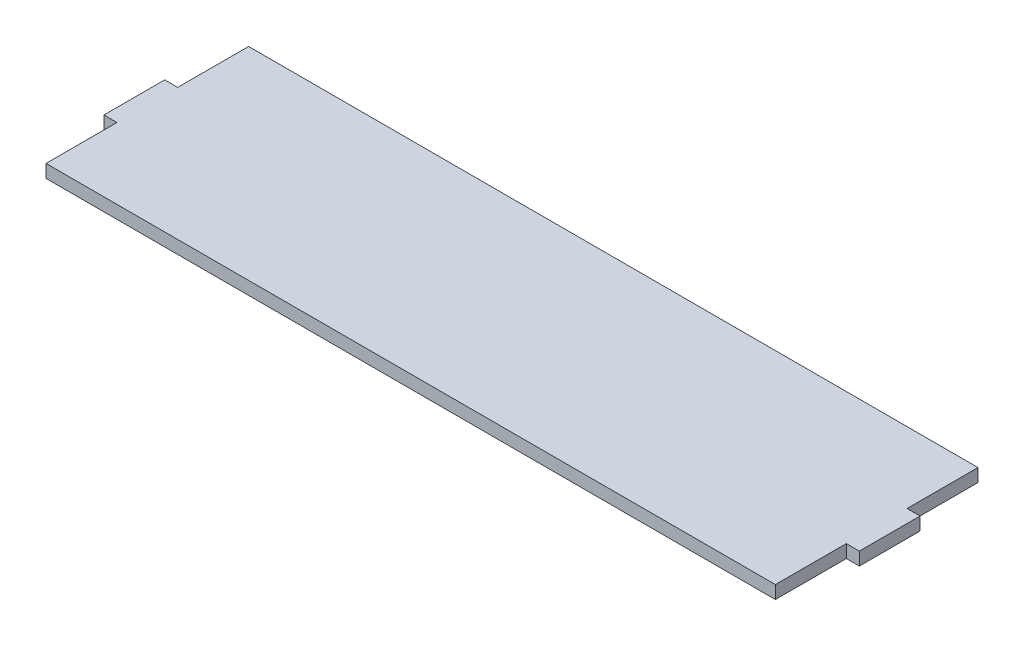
ISO-10303-21;
HEADER;
FILE_DESCRIPTION(('STEP AP214'),'2;1');
FILE_NAME('part.step','',(''),(''),'','','');
FILE_SCHEMA(('AUTOMOTIVE_DESIGN { 1 0 10303 214 1 1 1 1 }'));
ENDSEC;
DATA;
#1=APPLICATION_CONTEXT('core data for automotive mechanical design processes');
#2=APPLICATION_PROTOCOL_DEFINITION('international standard','automotive_design',2000,#1);
#3=PRODUCT_CONTEXT('',#1,'mechanical');
#4=PRODUCT('Part','Part','',(#3));
#5=PRODUCT_RELATED_PRODUCT_CATEGORY('part','',(#4));
#6=PRODUCT_DEFINITION_FORMATION('','',#4);
#7=PRODUCT_DEFINITION_CONTEXT('part definition',#1,'design');
#8=PRODUCT_DEFINITION('design','',#6,#7);
#9=PRODUCT_DEFINITION_SHAPE('','',#8);
#10=(LENGTH_UNIT() NAMED_UNIT(*) SI_UNIT(.MILLI.,.METRE.));
#11=(NAMED_UNIT(*) PLANE_ANGLE_UNIT() SI_UNIT($,.RADIAN.));
#12=(NAMED_UNIT(*) SI_UNIT($,.STERADIAN.) SOLID_ANGLE_UNIT());
#13=UNCERTAINTY_MEASURE_WITH_UNIT(LENGTH_MEASURE(1.E-05),#10,'distance_accuracy_value','');
#14=(GEOMETRIC_REPRESENTATION_CONTEXT(3) GLOBAL_UNCERTAINTY_ASSIGNED_CONTEXT((#13)) GLOBAL_UNIT_ASSIGNED_CONTEXT((#10,
#11,#12)) REPRESENTATION_CONTEXT('',''));
#15=CARTESIAN_POINT('',(0.,0.,0.));
#16=DIRECTION('',(0.,0.,1.));
#17=DIRECTION('',(1.,0.,0.));
#18=AXIS2_PLACEMENT_3D('',#15,#16,#17);
#19=CARTESIAN_POINT('',(-59.3719908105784,16.30000042,-145.823418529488));
#20=DIRECTION('',(1.,0.,0.));
#21=DIRECTION('',(0.,0.,-1.));
#22=AXIS2_PLACEMENT_3D('',#19,#20,#21);
#23=PLANE('',#22);
#24=DIRECTION('',(0.,0.,1.));
#25=VECTOR('',#24,1.);
#26=CARTESIAN_POINT('',(-59.3719908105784,0.,-145.823418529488));
#27=LINE('',#26,#25);
#28=CARTESIAN_POINT('',(-59.3719908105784,0.,-234.723418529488));
#29=VERTEX_POINT('',#28);
#30=CARTESIAN_POINT('',(-59.3719908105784,0.,-145.823418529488));
#31=VERTEX_POINT('',#30);
#32=EDGE_CURVE('E153',#29,#31,#27,.T.);
#33=ORIENTED_EDGE('',*,*,#32,.T.);
#34=DIRECTION('',(0.,-1.,0.));
#35=VECTOR('',#34,1.);
#36=CARTESIAN_POINT('',(-59.3719908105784,16.30000042,-145.823418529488));
#37=LINE('',#36,#35);
#38=CARTESIAN_POINT('',(-59.3719908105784,16.30000042,-145.823418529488));
#39=VERTEX_POINT('',#38);
#40=EDGE_CURVE('E11',#39,#31,#37,.T.);
#41=ORIENTED_EDGE('',*,*,#40,.F.);
#42=DIRECTION('',(0.,0.,1.));
#43=VECTOR('',#42,1.);
#44=CARTESIAN_POINT('',(-59.3719908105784,16.30000042,-145.823418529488));
#45=LINE('',#44,#43);
#46=CARTESIAN_POINT('',(-59.3719908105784,16.30000042,-234.723418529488));
#47=VERTEX_POINT('',#46);
#48=EDGE_CURVE('E175',#47,#39,#45,.T.);
#49=ORIENTED_EDGE('',*,*,#48,.F.);
#50=DIRECTION('',(0.,-1.,0.));
#51=VECTOR('',#50,1.);
#52=CARTESIAN_POINT('',(-59.3719908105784,16.30000042,-234.723418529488));
#53=LINE('',#52,#51);
#54=EDGE_CURVE('E149',#47,#29,#53,.T.);
#55=ORIENTED_EDGE('',*,*,#54,.T.);
#56=EDGE_LOOP('',(#33,#41,#49,#55));
#57=FACE_BOUND('',#56,.T.);
#58=ADVANCED_FACE('F33',(#57),#23,.F.);
#59=CARTESIAN_POINT('',(-59.3719908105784,16.30000042,-145.823418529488));
#60=DIRECTION('',(0.,0.,1.));
#61=DIRECTION('',(1.,0.,0.));
#62=AXIS2_PLACEMENT_3D('',#59,#60,#61);
#63=PLANE('',#62);
#64=DIRECTION('',(-1.,0.,0.));
#65=VECTOR('',#64,1.);
#66=CARTESIAN_POINT('',(-59.3719908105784,0.,-145.823418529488));
#67=LINE('',#66,#65);
#68=CARTESIAN_POINT('',(-75.6719912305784,0.,-145.823418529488));
#69=VERTEX_POINT('',#68);
#70=EDGE_CURVE('E156',#31,#69,#67,.T.);
#71=ORIENTED_EDGE('',*,*,#70,.T.);
#72=DIRECTION('',(0.,-1.,0.));
#73=VECTOR('',#72,1.);
#74=CARTESIAN_POINT('',(-75.6719912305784,16.30000042,-145.823418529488));
#75=LINE('',#74,#73);
#76=CARTESIAN_POINT('',(-75.6719912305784,16.30000042,-145.823418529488));
#77=VERTEX_POINT('',#76);
#78=EDGE_CURVE('E41',#77,#69,#75,.T.);
#79=ORIENTED_EDGE('',*,*,#78,.F.);
#80=DIRECTION('',(-1.,0.,0.));
#81=VECTOR('',#80,1.);
#82=CARTESIAN_POINT('',(-59.3719908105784,16.30000042,-145.823418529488));
#83=LINE('',#82,#81);
#84=EDGE_CURVE('E104',#39,#77,#83,.T.);
#85=ORIENTED_EDGE('',*,*,#84,.F.);
#86=ORIENTED_EDGE('',*,*,#40,.T.);
#87=EDGE_LOOP('',(#71,#79,#85,#86));
#88=FACE_BOUND('',#87,.T.);
#89=ADVANCED_FACE('F253',(#88),#63,.F.);
#90=CARTESIAN_POINT('',(-75.6719912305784,16.30000042,-145.823418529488));
#91=DIRECTION('',(1.,0.,0.));
#92=DIRECTION('',(0.,0.,-1.));
#93=AXIS2_PLACEMENT_3D('',#90,#91,#92);
#94=PLANE('',#93);
#95=DIRECTION('',(0.,0.,1.));
#96=VECTOR('',#95,1.);
#97=CARTESIAN_POINT('',(-75.6719912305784,0.,-145.823418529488));
#98=LINE('',#97,#96);
#99=CARTESIAN_POINT('',(-75.6719912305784,0.,-69.6234185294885));
#100=VERTEX_POINT('',#99);
#101=EDGE_CURVE('E158',#69,#100,#98,.T.);
#102=ORIENTED_EDGE('',*,*,#101,.T.);
#103=DIRECTION('',(0.,-1.,0.));
#104=VECTOR('',#103,1.);
#105=CARTESIAN_POINT('',(-75.6719912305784,16.30000042,-69.6234185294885));
#106=LINE('',#105,#104);
#107=CARTESIAN_POINT('',(-75.6719912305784,16.30000042,-69.6234185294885));
#108=VERTEX_POINT('',#107);
#109=EDGE_CURVE('E194',#108,#100,#106,.T.);
#110=ORIENTED_EDGE('',*,*,#109,.F.);
#111=DIRECTION('',(0.,0.,1.));
#112=VECTOR('',#111,1.);
#113=CARTESIAN_POINT('',(-75.6719912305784,16.30000042,-145.823418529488));
#114=LINE('',#113,#112);
#115=EDGE_CURVE('E202',#77,#108,#114,.T.);
#116=ORIENTED_EDGE('',*,*,#115,.F.);
#117=ORIENTED_EDGE('',*,*,#78,.T.);
#118=EDGE_LOOP('',(#102,#110,#116,#117));
#119=FACE_BOUND('',#118,.T.);
#120=ADVANCED_FACE('F200',(#119),#94,.F.);
#121=CARTESIAN_POINT('',(-75.6719912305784,16.30000042,-69.6234185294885));
#122=DIRECTION('',(0.,0.,-1.));
#123=DIRECTION('',(-1.,0.,0.));
#124=AXIS2_PLACEMENT_3D('',#121,#122,#123);
#125=PLANE('',#124);
#126=DIRECTION('',(1.,0.,0.));
#127=VECTOR('',#126,1.);
#128=CARTESIAN_POINT('',(-75.6719912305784,0.,-69.6234185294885));
#129=LINE('',#128,#127);
#130=CARTESIAN_POINT('',(-59.3719908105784,0.,-69.6234185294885));
#131=VERTEX_POINT('',#130);
#132=EDGE_CURVE('E160',#100,#131,#129,.T.);
#133=ORIENTED_EDGE('',*,*,#132,.T.);
#134=DIRECTION('',(0.,-1.,0.));
#135=VECTOR('',#134,1.);
#136=CARTESIAN_POINT('',(-59.3719908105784,16.30000042,-69.6234185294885));
#137=LINE('',#136,#135);
#138=CARTESIAN_POINT('',(-59.3719908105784,16.30000042,-69.6234185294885));
#139=VERTEX_POINT('',#138);
#140=EDGE_CURVE('E191',#139,#131,#137,.T.);
#141=ORIENTED_EDGE('',*,*,#140,.F.);
#142=DIRECTION('',(1.,0.,0.));
#143=VECTOR('',#142,1.);
#144=CARTESIAN_POINT('',(-75.6719912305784,16.30000042,-69.6234185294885));
#145=LINE('',#144,#143);
#146=EDGE_CURVE('E220',#108,#139,#145,.T.);
#147=ORIENTED_EDGE('',*,*,#146,.F.);
#148=ORIENTED_EDGE('',*,*,#109,.T.);
#149=EDGE_LOOP('',(#133,#141,#147,#148));
#150=FACE_BOUND('',#149,.T.);
#151=ADVANCED_FACE('F211',(#150),#125,.F.);
#152=CARTESIAN_POINT('',(-59.3719908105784,16.30000042,-69.6234185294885));
#153=DIRECTION('',(1.,0.,0.));
#154=DIRECTION('',(0.,0.,-1.));
#155=AXIS2_PLACEMENT_3D('',#152,#153,#154);
#156=PLANE('',#155);
#157=DIRECTION('',(0.,0.,1.));
#158=VECTOR('',#157,1.);
#159=CARTESIAN_POINT('',(-59.3719908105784,0.,-69.6234185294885));
#160=LINE('',#159,#158);
#161=CARTESIAN_POINT('',(-59.3719908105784,0.,19.2765814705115));
#162=VERTEX_POINT('',#161);
#163=EDGE_CURVE('E162',#131,#162,#160,.T.);
#164=ORIENTED_EDGE('',*,*,#163,.T.);
#165=DIRECTION('',(0.,-1.,0.));
#166=VECTOR('',#165,1.);
#167=CARTESIAN_POINT('',(-59.3719908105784,16.30000042,19.2765814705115));
#168=LINE('',#167,#166);
#169=CARTESIAN_POINT('',(-59.3719908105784,16.30000042,19.2765814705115));
#170=VERTEX_POINT('',#169);
#171=EDGE_CURVE('E188',#170,#162,#168,.T.);
#172=ORIENTED_EDGE('',*,*,#171,.F.);
#173=DIRECTION('',(0.,0.,1.));
#174=VECTOR('',#173,1.);
#175=CARTESIAN_POINT('',(-59.3719908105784,16.30000042,-69.6234185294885));
#176=LINE('',#175,#174);
#177=EDGE_CURVE('E217',#139,#170,#176,.T.);
#178=ORIENTED_EDGE('',*,*,#177,.F.);
#179=ORIENTED_EDGE('',*,*,#140,.T.);
#180=EDGE_LOOP('',(#164,#172,#178,#179));
#181=FACE_BOUND('',#180,.T.);
#182=ADVANCED_FACE('F215',(#181),#156,.F.);
#183=CARTESIAN_POINT('',(-59.3719908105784,16.30000042,19.2765814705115));
#184=DIRECTION('',(0.,0.,-1.));
#185=DIRECTION('',(-1.,0.,0.));
#186=AXIS2_PLACEMENT_3D('',#183,#184,#185);
#187=PLANE('',#186);
#188=DIRECTION('',(1.,0.,0.));
#189=VECTOR('',#188,1.);
#190=CARTESIAN_POINT('',(-59.3719908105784,0.,19.2765814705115));
#191=LINE('',#190,#189);
#192=CARTESIAN_POINT('',(855.028009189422,0.,19.2765814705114));
#193=VERTEX_POINT('',#192);
#194=EDGE_CURVE('E164',#162,#193,#191,.T.);
#195=ORIENTED_EDGE('',*,*,#194,.T.);
#196=DIRECTION('',(0.,-1.,0.));
#197=VECTOR('',#196,1.);
#198=CARTESIAN_POINT('',(855.028009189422,16.30000042,19.2765814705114));
#199=LINE('',#198,#197);
#200=CARTESIAN_POINT('',(855.028009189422,16.30000042,19.2765814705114));
#201=VERTEX_POINT('',#200);
#202=EDGE_CURVE('E185',#201,#193,#199,.T.);
#203=ORIENTED_EDGE('',*,*,#202,.F.);
#204=DIRECTION('',(1.,0.,0.));
#205=VECTOR('',#204,1.);
#206=CARTESIAN_POINT('',(-59.3719908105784,16.30000042,19.2765814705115));
#207=LINE('',#206,#205);
#208=EDGE_CURVE('E219',#170,#201,#207,.T.);
#209=ORIENTED_EDGE('',*,*,#208,.F.);
#210=ORIENTED_EDGE('',*,*,#171,.T.);
#211=EDGE_LOOP('',(#195,#203,#209,#210));
#212=FACE_BOUND('',#211,.T.);
#213=ADVANCED_FACE('F266',(#212),#187,.F.);
#214=CARTESIAN_POINT('',(855.028009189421,16.30000042,-69.6234185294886));
#215=DIRECTION('',(-1.,0.,0.));
#216=DIRECTION('',(0.,0.,1.));
#217=AXIS2_PLACEMENT_3D('',#214,#215,#216);
#218=PLANE('',#217);
#219=DIRECTION('',(0.,0.,-1.));
#220=VECTOR('',#219,1.);
#221=CARTESIAN_POINT('',(855.028009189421,0.,-69.6234185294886));
#222=LINE('',#221,#220);
#223=CARTESIAN_POINT('',(855.028009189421,0.,-69.6234185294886));
#224=VERTEX_POINT('',#223);
#225=EDGE_CURVE('E166',#193,#224,#222,.T.);
#226=ORIENTED_EDGE('',*,*,#225,.T.);
#227=DIRECTION('',(0.,-1.,0.));
#228=VECTOR('',#227,1.);
#229=CARTESIAN_POINT('',(855.028009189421,16.30000042,-69.6234185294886));
#230=LINE('',#229,#228);
#231=CARTESIAN_POINT('',(855.028009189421,16.30000042,-69.6234185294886));
#232=VERTEX_POINT('',#231);
#233=EDGE_CURVE('E182',#232,#224,#230,.T.);
#234=ORIENTED_EDGE('',*,*,#233,.F.);
#235=DIRECTION('',(0.,0.,-1.));
#236=VECTOR('',#235,1.);
#237=CARTESIAN_POINT('',(855.028009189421,16.30000042,-69.6234185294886));
#238=LINE('',#237,#236);
#239=EDGE_CURVE('E222',#201,#232,#238,.T.);
#240=ORIENTED_EDGE('',*,*,#239,.F.);
#241=ORIENTED_EDGE('',*,*,#202,.T.);
#242=EDGE_LOOP('',(#226,#234,#240,#241));
#243=FACE_BOUND('',#242,.T.);
#244=ADVANCED_FACE('F269',(#243),#218,.F.);
#245=CARTESIAN_POINT('',(871.328009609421,16.30000042,-69.6234185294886));
#246=DIRECTION('',(0.,0.,-1.));
#247=DIRECTION('',(-1.,0.,0.));
#248=AXIS2_PLACEMENT_3D('',#245,#246,#247);
#249=PLANE('',#248);
#250=DIRECTION('',(1.,0.,0.));
#251=VECTOR('',#250,1.);
#252=CARTESIAN_POINT('',(871.328009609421,0.,-69.6234185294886));
#253=LINE('',#252,#251);
#254=CARTESIAN_POINT('',(871.328009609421,0.,-69.6234185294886));
#255=VERTEX_POINT('',#254);
#256=EDGE_CURVE('E168',#224,#255,#253,.T.);
#257=ORIENTED_EDGE('',*,*,#256,.T.);
#258=DIRECTION('',(0.,-1.,0.));
#259=VECTOR('',#258,1.);
#260=CARTESIAN_POINT('',(871.328009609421,16.30000042,-69.6234185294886));
#261=LINE('',#260,#259);
#262=CARTESIAN_POINT('',(871.328009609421,16.30000042,-69.6234185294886));
#263=VERTEX_POINT('',#262);
#264=EDGE_CURVE('E179',#263,#255,#261,.T.);
#265=ORIENTED_EDGE('',*,*,#264,.F.);
#266=DIRECTION('',(1.,0.,0.));
#267=VECTOR('',#266,1.);
#268=CARTESIAN_POINT('',(871.328009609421,16.30000042,-69.6234185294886));
#269=LINE('',#268,#267);
#270=EDGE_CURVE('E228',#232,#263,#269,.T.);
#271=ORIENTED_EDGE('',*,*,#270,.F.);
#272=ORIENTED_EDGE('',*,*,#233,.T.);
#273=EDGE_LOOP('',(#257,#265,#271,#272));
#274=FACE_BOUND('',#273,.T.);
#275=ADVANCED_FACE('F234',(#274),#249,.F.);
#276=CARTESIAN_POINT('',(871.328009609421,16.30000042,-145.823418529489));
#277=DIRECTION('',(-1.,0.,0.));
#278=DIRECTION('',(0.,0.,1.));
#279=AXIS2_PLACEMENT_3D('',#276,#277,#278);
#280=PLANE('',#279);
#281=DIRECTION('',(0.,0.,-1.));
#282=VECTOR('',#281,1.);
#283=CARTESIAN_POINT('',(871.328009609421,0.,-145.823418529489));
#284=LINE('',#283,#282);
#285=CARTESIAN_POINT('',(871.328009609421,0.,-145.823418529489));
#286=VERTEX_POINT('',#285);
#287=EDGE_CURVE('E170',#255,#286,#284,.T.);
#288=ORIENTED_EDGE('',*,*,#287,.T.);
#289=DIRECTION('',(0.,-1.,0.));
#290=VECTOR('',#289,1.);
#291=CARTESIAN_POINT('',(871.328009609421,16.30000042,-145.823418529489));
#292=LINE('',#291,#290);
#293=CARTESIAN_POINT('',(871.328009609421,16.30000042,-145.823418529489));
#294=VERTEX_POINT('',#293);
#295=EDGE_CURVE('E144',#294,#286,#292,.T.);
#296=ORIENTED_EDGE('',*,*,#295,.F.);
#297=DIRECTION('',(0.,0.,-1.));
#298=VECTOR('',#297,1.);
#299=CARTESIAN_POINT('',(871.328009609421,16.30000042,-145.823418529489));
#300=LINE('',#299,#298);
#301=EDGE_CURVE('E135',#263,#294,#300,.T.);
#302=ORIENTED_EDGE('',*,*,#301,.F.);
#303=ORIENTED_EDGE('',*,*,#264,.T.);
#304=EDGE_LOOP('',(#288,#296,#302,#303));
#305=FACE_BOUND('',#304,.T.);
#306=ADVANCED_FACE('F238',(#305),#280,.F.);
#307=CARTESIAN_POINT('',(855.028009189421,16.30000042,-145.823418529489));
#308=DIRECTION('',(0.,0.,1.));
#309=DIRECTION('',(1.,0.,0.));
#310=AXIS2_PLACEMENT_3D('',#307,#308,#309);
#311=PLANE('',#310);
#312=DIRECTION('',(-1.,0.,0.));
#313=VECTOR('',#312,1.);
#314=CARTESIAN_POINT('',(855.028009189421,0.,-145.823418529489));
#315=LINE('',#314,#313);
#316=CARTESIAN_POINT('',(855.028009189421,0.,-145.823418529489));
#317=VERTEX_POINT('',#316);
#318=EDGE_CURVE('E143',#286,#317,#315,.T.);
#319=ORIENTED_EDGE('',*,*,#318,.T.);
#320=DIRECTION('',(0.,-1.,0.));
#321=VECTOR('',#320,1.);
#322=CARTESIAN_POINT('',(855.028009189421,16.30000042,-145.823418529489));
#323=LINE('',#322,#321);
#324=CARTESIAN_POINT('',(855.028009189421,16.30000042,-145.823418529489));
#325=VERTEX_POINT('',#324);
#326=EDGE_CURVE('E140',#325,#317,#323,.T.);
#327=ORIENTED_EDGE('',*,*,#326,.F.);
#328=DIRECTION('',(-1.,0.,0.));
#329=VECTOR('',#328,1.);
#330=CARTESIAN_POINT('',(855.028009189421,16.30000042,-145.823418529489));
#331=LINE('',#330,#329);
#332=EDGE_CURVE('E129',#294,#325,#331,.T.);
#333=ORIENTED_EDGE('',*,*,#332,.F.);
#334=ORIENTED_EDGE('',*,*,#295,.T.);
#335=EDGE_LOOP('',(#319,#327,#333,#334));
#336=FACE_BOUND('',#335,.T.);
#337=ADVANCED_FACE('F141',(#336),#311,.F.);
#338=CARTESIAN_POINT('',(855.028009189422,16.30000042,-234.723418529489));
#339=DIRECTION('',(-1.,0.,0.));
#340=DIRECTION('',(0.,0.,1.));
#341=AXIS2_PLACEMENT_3D('',#338,#339,#340);
#342=PLANE('',#341);
#343=DIRECTION('',(0.,0.,-1.));
#344=VECTOR('',#343,1.);
#345=CARTESIAN_POINT('',(855.028009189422,0.,-234.723418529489));
#346=LINE('',#345,#344);
#347=CARTESIAN_POINT('',(855.028009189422,0.,-234.723418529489));
#348=VERTEX_POINT('',#347);
#349=EDGE_CURVE('E90',#317,#348,#346,.T.);
#350=ORIENTED_EDGE('',*,*,#349,.T.);
#351=DIRECTION('',(0.,-1.,0.));
#352=VECTOR('',#351,1.);
#353=CARTESIAN_POINT('',(855.028009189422,16.30000042,-234.723418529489));
#354=LINE('',#353,#352);
#355=CARTESIAN_POINT('',(855.028009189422,16.30000042,-234.723418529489));
#356=VERTEX_POINT('',#355);
#357=EDGE_CURVE('E145',#356,#348,#354,.T.);
#358=ORIENTED_EDGE('',*,*,#357,.F.);
#359=DIRECTION('',(0.,0.,-1.));
#360=VECTOR('',#359,1.);
#361=CARTESIAN_POINT('',(855.028009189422,16.30000042,-234.723418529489));
#362=LINE('',#361,#360);
#363=EDGE_CURVE('E133',#325,#356,#362,.T.);
#364=ORIENTED_EDGE('',*,*,#363,.F.);
#365=ORIENTED_EDGE('',*,*,#326,.T.);
#366=EDGE_LOOP('',(#350,#358,#364,#365));
#367=FACE_BOUND('',#366,.T.);
#368=ADVANCED_FACE('F147',(#367),#342,.F.);
#369=CARTESIAN_POINT('',(-59.3719908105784,16.30000042,-234.723418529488));
#370=DIRECTION('',(0.,0.,1.));
#371=DIRECTION('',(1.,0.,0.));
#372=AXIS2_PLACEMENT_3D('',#369,#370,#371);
#373=PLANE('',#372);
#374=DIRECTION('',(-1.,0.,0.));
#375=VECTOR('',#374,1.);
#376=CARTESIAN_POINT('',(-59.3719908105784,0.,-234.723418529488));
#377=LINE('',#376,#375);
#378=EDGE_CURVE('E96',#348,#29,#377,.T.);
#379=ORIENTED_EDGE('',*,*,#378,.T.);
#380=ORIENTED_EDGE('',*,*,#54,.F.);
#381=DIRECTION('',(-1.,0.,0.));
#382=VECTOR('',#381,1.);
#383=CARTESIAN_POINT('',(-59.3719908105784,16.30000042,-234.723418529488));
#384=LINE('',#383,#382);
#385=EDGE_CURVE('E49',#356,#47,#384,.T.);
#386=ORIENTED_EDGE('',*,*,#385,.F.);
#387=ORIENTED_EDGE('',*,*,#357,.T.);
#388=EDGE_LOOP('',(#379,#380,#386,#387));
#389=FACE_BOUND('',#388,.T.);
#390=ADVANCED_FACE('F242',(#389),#373,.F.);
#391=CARTESIAN_POINT('',(0.,16.30000042,0.));
#392=DIRECTION('',(0.,-1.,0.));
#393=DIRECTION('',(0.,0.,-1.));
#394=AXIS2_PLACEMENT_3D('',#391,#392,#393);
#395=PLANE('',#394);
#396=ORIENTED_EDGE('',*,*,#48,.T.);
#397=ORIENTED_EDGE('',*,*,#84,.T.);
#398=ORIENTED_EDGE('',*,*,#115,.T.);
#399=ORIENTED_EDGE('',*,*,#146,.T.);
#400=ORIENTED_EDGE('',*,*,#177,.T.);
#401=ORIENTED_EDGE('',*,*,#208,.T.);
#402=ORIENTED_EDGE('',*,*,#239,.T.);
#403=ORIENTED_EDGE('',*,*,#270,.T.);
#404=ORIENTED_EDGE('',*,*,#301,.T.);
#405=ORIENTED_EDGE('',*,*,#332,.T.);
#406=ORIENTED_EDGE('',*,*,#363,.T.);
#407=ORIENTED_EDGE('',*,*,#385,.T.);
#408=EDGE_LOOP('',(#396,#397,#398,#399,#400,#401,#402,#403,#404,#405,#406,#407));
#409=FACE_BOUND('',#408,.T.);
#410=ADVANCED_FACE('F131',(#409),#395,.F.);
#411=CARTESIAN_POINT('',(0.,0.,0.));
#412=DIRECTION('',(0.,-1.,0.));
#413=DIRECTION('',(0.,0.,-1.));
#414=AXIS2_PLACEMENT_3D('',#411,#412,#413);
#415=PLANE('',#414);
#416=ORIENTED_EDGE('',*,*,#32,.F.);
#417=ORIENTED_EDGE('',*,*,#378,.F.);
#418=ORIENTED_EDGE('',*,*,#349,.F.);
#419=ORIENTED_EDGE('',*,*,#318,.F.);
#420=ORIENTED_EDGE('',*,*,#287,.F.);
#421=ORIENTED_EDGE('',*,*,#256,.F.);
#422=ORIENTED_EDGE('',*,*,#225,.F.);
#423=ORIENTED_EDGE('',*,*,#194,.F.);
#424=ORIENTED_EDGE('',*,*,#163,.F.);
#425=ORIENTED_EDGE('',*,*,#132,.F.);
#426=ORIENTED_EDGE('',*,*,#101,.F.);
#427=ORIENTED_EDGE('',*,*,#70,.F.);
#428=EDGE_LOOP('',(#416,#417,#418,#419,#420,#421,#422,#423,#424,#425,#426,#427));
#429=FACE_BOUND('',#428,.T.);
#430=ADVANCED_FACE('F206',(#429),#415,.T.);
#431=CLOSED_SHELL('',(#58,#89,#120,#151,#182,#213,#244,#275,#306,#337,#368,#390,#410,#430));
#432=MANIFOLD_SOLID_BREP('B2',#431);
#433=ADVANCED_BREP_SHAPE_REPRESENTATION('',(#18,#432),#14);
#434=SHAPE_DEFINITION_REPRESENTATION(#9,#433);
ENDSEC;
END-ISO-10303-21;
